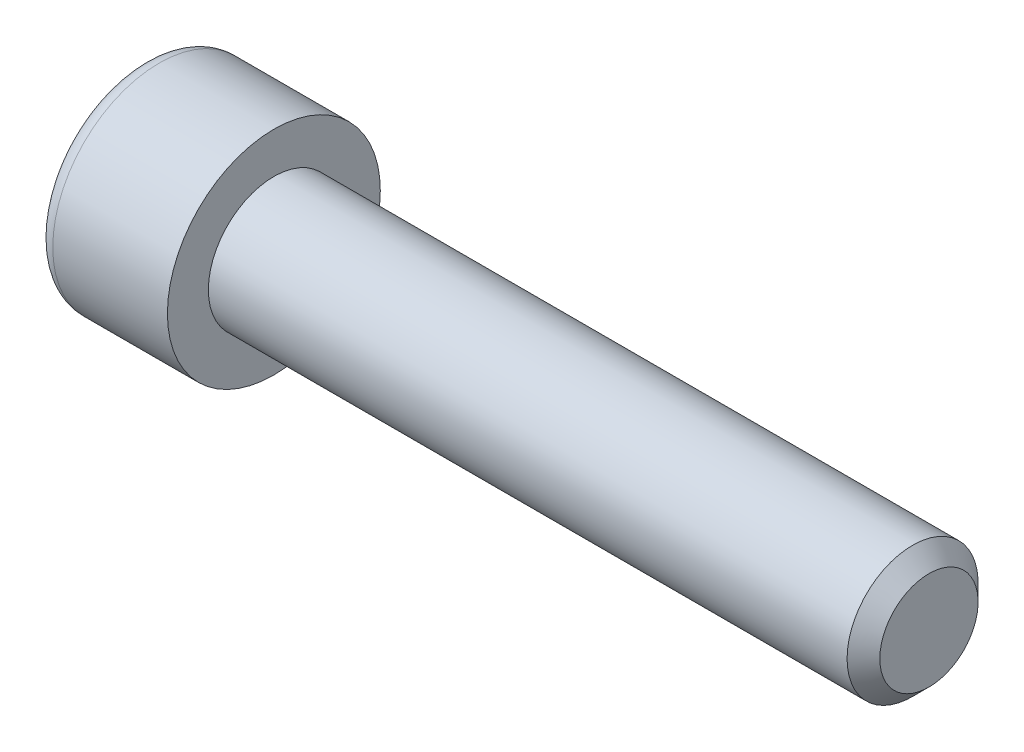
ISO-10303-21;
HEADER;
FILE_DESCRIPTION(('STEP AP214'),'2;1');
FILE_NAME('part.step','',(''),(''),'','','');
FILE_SCHEMA(('AUTOMOTIVE_DESIGN { 1 0 10303 214 1 1 1 1 }'));
ENDSEC;
DATA;
#1=APPLICATION_CONTEXT('core data for automotive mechanical design processes');
#2=APPLICATION_PROTOCOL_DEFINITION('international standard','automotive_design',2000,#1);
#3=PRODUCT_CONTEXT('',#1,'mechanical');
#4=PRODUCT('Part','Part','',(#3));
#5=PRODUCT_RELATED_PRODUCT_CATEGORY('part','',(#4));
#6=PRODUCT_DEFINITION_FORMATION('','',#4);
#7=PRODUCT_DEFINITION_CONTEXT('part definition',#1,'design');
#8=PRODUCT_DEFINITION('design','',#6,#7);
#9=PRODUCT_DEFINITION_SHAPE('','',#8);
#10=(LENGTH_UNIT() NAMED_UNIT(*) SI_UNIT(.MILLI.,.METRE.));
#11=(NAMED_UNIT(*) PLANE_ANGLE_UNIT() SI_UNIT($,.RADIAN.));
#12=(NAMED_UNIT(*) SI_UNIT($,.STERADIAN.) SOLID_ANGLE_UNIT());
#13=UNCERTAINTY_MEASURE_WITH_UNIT(LENGTH_MEASURE(1.E-05),#10,'distance_accuracy_value','');
#14=(GEOMETRIC_REPRESENTATION_CONTEXT(3) GLOBAL_UNCERTAINTY_ASSIGNED_CONTEXT((#13)) GLOBAL_UNIT_ASSIGNED_CONTEXT((#10,
#11,#12)) REPRESENTATION_CONTEXT('',''));
#15=CARTESIAN_POINT('',(0.,0.,0.));
#16=DIRECTION('',(0.,0.,1.));
#17=DIRECTION('',(1.,0.,0.));
#18=AXIS2_PLACEMENT_3D('',#15,#16,#17);
#19=CARTESIAN_POINT('',(-8.,0.,0.));
#20=DIRECTION('',(-1.,0.,0.));
#21=DIRECTION('',(0.,0.,1.));
#22=AXIS2_PLACEMENT_3D('',#19,#20,#21);
#23=PLANE('',#22);
#24=CARTESIAN_POINT('',(-8.,0.,0.));
#25=DIRECTION('',(-1.,0.,0.));
#26=DIRECTION('',(0.,0.,1.));
#27=AXIS2_PLACEMENT_3D('',#24,#25,#26);
#28=CIRCLE('',#27,5.49999999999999);
#29=CARTESIAN_POINT('',(-8.,0.,5.49999999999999));
#30=VERTEX_POINT('',#29);
#31=EDGE_CURVE('E101',#30,#30,#28,.T.);
#32=ORIENTED_EDGE('',*,*,#31,.T.);
#33=EDGE_LOOP('',(#32));
#34=FACE_BOUND('',#33,.T.);
#35=DIRECTION('',(0.,0.866025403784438,-0.5));
#36=VECTOR('',#35,1.);
#37=CARTESIAN_POINT('',(-8.,-3.08460754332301,-1.73205080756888));
#38=LINE('',#37,#36);
#39=CARTESIAN_POINT('',(-8.,-3.08460754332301,-1.73205080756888));
#40=VERTEX_POINT('',#39);
#41=CARTESIAN_POINT('',(-8.,-0.0846075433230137,-3.46410161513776));
#42=VERTEX_POINT('',#41);
#43=EDGE_CURVE('E106',#40,#42,#38,.T.);
#44=ORIENTED_EDGE('',*,*,#43,.T.);
#45=DIRECTION('',(0.,0.866025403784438,0.5));
#46=VECTOR('',#45,1.);
#47=CARTESIAN_POINT('',(-8.,-0.0846075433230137,-3.46410161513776));
#48=LINE('',#47,#46);
#49=CARTESIAN_POINT('',(-8.,2.91539245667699,-1.73205080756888));
#50=VERTEX_POINT('',#49);
#51=EDGE_CURVE('E47',#42,#50,#48,.T.);
#52=ORIENTED_EDGE('',*,*,#51,.T.);
#53=DIRECTION('',(0.,0.,1.));
#54=VECTOR('',#53,1.);
#55=CARTESIAN_POINT('',(-8.,2.91539245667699,-1.73205080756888));
#56=LINE('',#55,#54);
#57=CARTESIAN_POINT('',(-8.,2.91539245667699,1.73205080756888));
#58=VERTEX_POINT('',#57);
#59=EDGE_CURVE('E87',#50,#58,#56,.T.);
#60=ORIENTED_EDGE('',*,*,#59,.T.);
#61=DIRECTION('',(0.,-0.866025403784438,0.500000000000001));
#62=VECTOR('',#61,1.);
#63=CARTESIAN_POINT('',(-8.,2.91539245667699,1.73205080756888));
#64=LINE('',#63,#62);
#65=CARTESIAN_POINT('',(-8.,-0.0846075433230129,3.46410161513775));
#66=VERTEX_POINT('',#65);
#67=EDGE_CURVE('E95',#58,#66,#64,.T.);
#68=ORIENTED_EDGE('',*,*,#67,.T.);
#69=DIRECTION('',(0.,-0.866025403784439,-0.5));
#70=VECTOR('',#69,1.);
#71=CARTESIAN_POINT('',(-8.,-0.0846075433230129,3.46410161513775));
#72=LINE('',#71,#70);
#73=CARTESIAN_POINT('',(-8.,-3.08460754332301,1.73205080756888));
#74=VERTEX_POINT('',#73);
#75=EDGE_CURVE('E110',#66,#74,#72,.T.);
#76=ORIENTED_EDGE('',*,*,#75,.T.);
#77=DIRECTION('',(0.,0.,-1.));
#78=VECTOR('',#77,1.);
#79=CARTESIAN_POINT('',(-8.,-3.08460754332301,1.73205080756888));
#80=LINE('',#79,#78);
#81=EDGE_CURVE('E113',#74,#40,#80,.T.);
#82=ORIENTED_EDGE('',*,*,#81,.T.);
#83=EDGE_LOOP('',(#44,#52,#60,#68,#76,#82));
#84=FACE_BOUND('',#83,.T.);
#85=ADVANCED_FACE('F32',(#34,#84),#23,.T.);
#86=CARTESIAN_POINT('',(40.,3.,0.));
#87=DIRECTION('',(1.,0.,0.));
#88=DIRECTION('',(0.,0.,-1.));
#89=AXIS2_PLACEMENT_3D('',#86,#87,#88);
#90=PLANE('',#89);
#91=CARTESIAN_POINT('',(40.,0.,0.));
#92=DIRECTION('',(-1.,0.,0.));
#93=DIRECTION('',(0.,0.,1.));
#94=AXIS2_PLACEMENT_3D('',#91,#92,#93);
#95=CIRCLE('',#94,3.);
#96=CARTESIAN_POINT('',(40.,0.,3.));
#97=VERTEX_POINT('',#96);
#98=EDGE_CURVE('E11',#97,#97,#95,.T.);
#99=ORIENTED_EDGE('',*,*,#98,.F.);
#100=EDGE_LOOP('',(#99));
#101=FACE_BOUND('',#100,.T.);
#102=ADVANCED_FACE('F34',(#101),#90,.T.);
#103=CARTESIAN_POINT('',(39.,0.,0.));
#104=DIRECTION('',(-1.,0.,0.));
#105=DIRECTION('',(0.,0.,1.));
#106=AXIS2_PLACEMENT_3D('',#103,#104,#105);
#107=CONICAL_SURFACE('',#106,3.99999999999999,0.785398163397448);
#108=ORIENTED_EDGE('',*,*,#98,.T.);
#109=EDGE_LOOP('',(#108));
#110=FACE_BOUND('',#109,.T.);
#111=CARTESIAN_POINT('',(39.,0.,0.));
#112=DIRECTION('',(-1.,0.,0.));
#113=DIRECTION('',(0.,0.,1.));
#114=AXIS2_PLACEMENT_3D('',#111,#112,#113);
#115=CIRCLE('',#114,3.99999999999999);
#116=CARTESIAN_POINT('',(39.,0.,3.99999999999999));
#117=VERTEX_POINT('',#116);
#118=EDGE_CURVE('E40',#117,#117,#115,.T.);
#119=ORIENTED_EDGE('',*,*,#118,.F.);
#120=EDGE_LOOP('',(#119));
#121=FACE_BOUND('',#120,.T.);
#122=ADVANCED_FACE('F151',(#110,#121),#107,.T.);
#123=CARTESIAN_POINT('',(-28.5761966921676,0.,0.));
#124=DIRECTION('',(-1.,0.,0.));
#125=DIRECTION('',(0.,0.,1.));
#126=AXIS2_PLACEMENT_3D('',#123,#124,#125);
#127=CYLINDRICAL_SURFACE('',#126,3.99999999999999);
#128=ORIENTED_EDGE('',*,*,#118,.T.);
#129=EDGE_LOOP('',(#128));
#130=FACE_BOUND('',#129,.T.);
#131=CARTESIAN_POINT('',(0.,0.,0.));
#132=DIRECTION('',(-1.,0.,0.));
#133=DIRECTION('',(0.,0.,1.));
#134=AXIS2_PLACEMENT_3D('',#131,#132,#133);
#135=CIRCLE('',#134,3.99999999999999);
#136=CARTESIAN_POINT('',(0.,0.,3.99999999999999));
#137=VERTEX_POINT('',#136);
#138=EDGE_CURVE('E143',#137,#137,#135,.T.);
#139=ORIENTED_EDGE('',*,*,#138,.F.);
#140=EDGE_LOOP('',(#139));
#141=FACE_BOUND('',#140,.T.);
#142=ADVANCED_FACE('F148',(#130,#141),#127,.T.);
#143=CARTESIAN_POINT('',(0.,6.49999999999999,0.));
#144=DIRECTION('',(1.,0.,0.));
#145=DIRECTION('',(0.,0.,-1.));
#146=AXIS2_PLACEMENT_3D('',#143,#144,#145);
#147=PLANE('',#146);
#148=ORIENTED_EDGE('',*,*,#138,.T.);
#149=EDGE_LOOP('',(#148));
#150=FACE_BOUND('',#149,.T.);
#151=CARTESIAN_POINT('',(0.,0.,0.));
#152=DIRECTION('',(-1.,0.,0.));
#153=DIRECTION('',(0.,0.,1.));
#154=AXIS2_PLACEMENT_3D('',#151,#152,#153);
#155=CIRCLE('',#154,6.49999999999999);
#156=CARTESIAN_POINT('',(0.,0.,6.49999999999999));
#157=VERTEX_POINT('',#156);
#158=EDGE_CURVE('E140',#157,#157,#155,.T.);
#159=ORIENTED_EDGE('',*,*,#158,.F.);
#160=EDGE_LOOP('',(#159));
#161=FACE_BOUND('',#160,.T.);
#162=ADVANCED_FACE('F158',(#150,#161),#147,.T.);
#163=CARTESIAN_POINT('',(-28.5761966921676,0.,0.));
#164=DIRECTION('',(-1.,0.,0.));
#165=DIRECTION('',(0.,0.,1.));
#166=AXIS2_PLACEMENT_3D('',#163,#164,#165);
#167=CYLINDRICAL_SURFACE('',#166,6.49999999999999);
#168=ORIENTED_EDGE('',*,*,#158,.T.);
#169=EDGE_LOOP('',(#168));
#170=FACE_BOUND('',#169,.T.);
#171=CARTESIAN_POINT('',(-7.,0.,0.));
#172=DIRECTION('',(-1.,0.,0.));
#173=DIRECTION('',(0.,0.,1.));
#174=AXIS2_PLACEMENT_3D('',#171,#172,#173);
#175=CIRCLE('',#174,6.49999999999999);
#176=CARTESIAN_POINT('',(-7.,0.,6.49999999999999));
#177=VERTEX_POINT('',#176);
#178=EDGE_CURVE('E137',#177,#177,#175,.T.);
#179=ORIENTED_EDGE('',*,*,#178,.F.);
#180=EDGE_LOOP('',(#179));
#181=FACE_BOUND('',#180,.T.);
#182=ADVANCED_FACE('F172',(#170,#181),#167,.T.);
#183=CARTESIAN_POINT('',(-7.,0.,0.));
#184=DIRECTION('',(-1.,0.,0.));
#185=DIRECTION('',(0.,0.,1.));
#186=AXIS2_PLACEMENT_3D('',#183,#184,#185);
#187=TOROIDAL_SURFACE('',#186,5.49999999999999,1.);
#188=ORIENTED_EDGE('',*,*,#31,.F.);
#189=EDGE_LOOP('',(#188));
#190=FACE_BOUND('',#189,.T.);
#191=ORIENTED_EDGE('',*,*,#178,.T.);
#192=EDGE_LOOP('',(#191));
#193=FACE_BOUND('',#192,.T.);
#194=ADVANCED_FACE('F169',(#190,#193),#187,.T.);
#195=CARTESIAN_POINT('',(-4.,-0.0846075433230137,-3.46410161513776));
#196=DIRECTION('',(0.,-0.5,0.866025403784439));
#197=DIRECTION('',(0.,-0.866025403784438,-0.5));
#198=AXIS2_PLACEMENT_3D('',#195,#196,#197);
#199=PLANE('',#198);
#200=ORIENTED_EDGE('',*,*,#51,.F.);
#201=DIRECTION('',(-1.,0.,0.));
#202=VECTOR('',#201,1.);
#203=CARTESIAN_POINT('',(-4.,-0.0846075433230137,-3.46410161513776));
#204=LINE('',#203,#202);
#205=CARTESIAN_POINT('',(-4.,-0.0846075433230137,-3.46410161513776));
#206=VERTEX_POINT('',#205);
#207=EDGE_CURVE('E126',#206,#42,#204,.T.);
#208=ORIENTED_EDGE('',*,*,#207,.F.);
#209=DIRECTION('',(0.,0.866025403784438,0.5));
#210=VECTOR('',#209,1.);
#211=CARTESIAN_POINT('',(-4.,-0.0846075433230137,-3.46410161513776));
#212=LINE('',#211,#210);
#213=CARTESIAN_POINT('',(-4.,2.91539245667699,-1.73205080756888));
#214=VERTEX_POINT('',#213);
#215=EDGE_CURVE('E100',#206,#214,#212,.T.);
#216=ORIENTED_EDGE('',*,*,#215,.T.);
#217=DIRECTION('',(-1.,0.,0.));
#218=VECTOR('',#217,1.);
#219=CARTESIAN_POINT('',(-4.,2.91539245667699,-1.73205080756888));
#220=LINE('',#219,#218);
#221=EDGE_CURVE('E89',#214,#50,#220,.T.);
#222=ORIENTED_EDGE('',*,*,#221,.T.);
#223=EDGE_LOOP('',(#200,#208,#216,#222));
#224=FACE_BOUND('',#223,.T.);
#225=ADVANCED_FACE('F98',(#224),#199,.T.);
#226=CARTESIAN_POINT('',(-4.,2.91539245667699,-1.73205080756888));
#227=DIRECTION('',(0.,-1.,0.));
#228=DIRECTION('',(0.,0.,-1.));
#229=AXIS2_PLACEMENT_3D('',#226,#227,#228);
#230=PLANE('',#229);
#231=ORIENTED_EDGE('',*,*,#59,.F.);
#232=ORIENTED_EDGE('',*,*,#221,.F.);
#233=DIRECTION('',(0.,0.,1.));
#234=VECTOR('',#233,1.);
#235=CARTESIAN_POINT('',(-4.,2.91539245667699,-1.73205080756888));
#236=LINE('',#235,#234);
#237=CARTESIAN_POINT('',(-4.,2.91539245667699,1.73205080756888));
#238=VERTEX_POINT('',#237);
#239=EDGE_CURVE('E117',#214,#238,#236,.T.);
#240=ORIENTED_EDGE('',*,*,#239,.T.);
#241=DIRECTION('',(-1.,0.,0.));
#242=VECTOR('',#241,1.);
#243=CARTESIAN_POINT('',(-4.,2.91539245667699,1.73205080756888));
#244=LINE('',#243,#242);
#245=EDGE_CURVE('E91',#238,#58,#244,.T.);
#246=ORIENTED_EDGE('',*,*,#245,.T.);
#247=EDGE_LOOP('',(#231,#232,#240,#246));
#248=FACE_BOUND('',#247,.T.);
#249=ADVANCED_FACE('F88',(#248),#230,.T.);
#250=CARTESIAN_POINT('',(-4.,2.91539245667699,1.73205080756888));
#251=DIRECTION('',(0.,-0.500000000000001,-0.866025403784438));
#252=DIRECTION('',(0.,0.866025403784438,-0.500000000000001));
#253=AXIS2_PLACEMENT_3D('',#250,#251,#252);
#254=PLANE('',#253);
#255=ORIENTED_EDGE('',*,*,#67,.F.);
#256=ORIENTED_EDGE('',*,*,#245,.F.);
#257=DIRECTION('',(0.,-0.866025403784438,0.500000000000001));
#258=VECTOR('',#257,1.);
#259=CARTESIAN_POINT('',(-4.,2.91539245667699,1.73205080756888));
#260=LINE('',#259,#258);
#261=CARTESIAN_POINT('',(-4.,-0.0846075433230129,3.46410161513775));
#262=VERTEX_POINT('',#261);
#263=EDGE_CURVE('E119',#238,#262,#260,.T.);
#264=ORIENTED_EDGE('',*,*,#263,.T.);
#265=DIRECTION('',(-1.,0.,0.));
#266=VECTOR('',#265,1.);
#267=CARTESIAN_POINT('',(-4.,-0.0846075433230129,3.46410161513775));
#268=LINE('',#267,#266);
#269=EDGE_CURVE('E132',#262,#66,#268,.T.);
#270=ORIENTED_EDGE('',*,*,#269,.T.);
#271=EDGE_LOOP('',(#255,#256,#264,#270));
#272=FACE_BOUND('',#271,.T.);
#273=ADVANCED_FACE('F209',(#272),#254,.T.);
#274=CARTESIAN_POINT('',(-4.,-0.0846075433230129,3.46410161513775));
#275=DIRECTION('',(0.,0.5,-0.866025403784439));
#276=DIRECTION('',(0.,0.866025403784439,0.5));
#277=AXIS2_PLACEMENT_3D('',#274,#275,#276);
#278=PLANE('',#277);
#279=ORIENTED_EDGE('',*,*,#75,.F.);
#280=ORIENTED_EDGE('',*,*,#269,.F.);
#281=DIRECTION('',(0.,-0.866025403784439,-0.5));
#282=VECTOR('',#281,1.);
#283=CARTESIAN_POINT('',(-4.,-0.0846075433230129,3.46410161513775));
#284=LINE('',#283,#282);
#285=CARTESIAN_POINT('',(-4.,-3.08460754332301,1.73205080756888));
#286=VERTEX_POINT('',#285);
#287=EDGE_CURVE('E121',#262,#286,#284,.T.);
#288=ORIENTED_EDGE('',*,*,#287,.T.);
#289=DIRECTION('',(-1.,0.,0.));
#290=VECTOR('',#289,1.);
#291=CARTESIAN_POINT('',(-4.,-3.08460754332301,1.73205080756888));
#292=LINE('',#291,#290);
#293=EDGE_CURVE('E130',#286,#74,#292,.T.);
#294=ORIENTED_EDGE('',*,*,#293,.T.);
#295=EDGE_LOOP('',(#279,#280,#288,#294));
#296=FACE_BOUND('',#295,.T.);
#297=ADVANCED_FACE('F215',(#296),#278,.T.);
#298=CARTESIAN_POINT('',(-4.,-3.08460754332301,1.73205080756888));
#299=DIRECTION('',(0.,1.,0.));
#300=DIRECTION('',(0.,0.,1.));
#301=AXIS2_PLACEMENT_3D('',#298,#299,#300);
#302=PLANE('',#301);
#303=ORIENTED_EDGE('',*,*,#81,.F.);
#304=ORIENTED_EDGE('',*,*,#293,.F.);
#305=DIRECTION('',(0.,0.,-1.));
#306=VECTOR('',#305,1.);
#307=CARTESIAN_POINT('',(-4.,-3.08460754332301,1.73205080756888));
#308=LINE('',#307,#306);
#309=CARTESIAN_POINT('',(-4.,-3.08460754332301,-1.73205080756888));
#310=VERTEX_POINT('',#309);
#311=EDGE_CURVE('E123',#286,#310,#308,.T.);
#312=ORIENTED_EDGE('',*,*,#311,.T.);
#313=DIRECTION('',(-1.,0.,0.));
#314=VECTOR('',#313,1.);
#315=CARTESIAN_POINT('',(-4.,-3.08460754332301,-1.73205080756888));
#316=LINE('',#315,#314);
#317=EDGE_CURVE('E128',#310,#40,#316,.T.);
#318=ORIENTED_EDGE('',*,*,#317,.T.);
#319=EDGE_LOOP('',(#303,#304,#312,#318));
#320=FACE_BOUND('',#319,.T.);
#321=ADVANCED_FACE('F223',(#320),#302,.T.);
#322=CARTESIAN_POINT('',(-4.,-3.08460754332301,-1.73205080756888));
#323=DIRECTION('',(0.,0.5,0.866025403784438));
#324=DIRECTION('',(0.,-0.866025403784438,0.5));
#325=AXIS2_PLACEMENT_3D('',#322,#323,#324);
#326=PLANE('',#325);
#327=ORIENTED_EDGE('',*,*,#43,.F.);
#328=ORIENTED_EDGE('',*,*,#317,.F.);
#329=DIRECTION('',(0.,0.866025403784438,-0.5));
#330=VECTOR('',#329,1.);
#331=CARTESIAN_POINT('',(-4.,-3.08460754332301,-1.73205080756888));
#332=LINE('',#331,#330);
#333=EDGE_CURVE('E54',#310,#206,#332,.T.);
#334=ORIENTED_EDGE('',*,*,#333,.T.);
#335=ORIENTED_EDGE('',*,*,#207,.T.);
#336=EDGE_LOOP('',(#327,#328,#334,#335));
#337=FACE_BOUND('',#336,.T.);
#338=ADVANCED_FACE('F231',(#337),#326,.T.);
#339=CARTESIAN_POINT('',(-4.,5.91539245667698,0.));
#340=DIRECTION('',(1.,0.,0.));
#341=DIRECTION('',(0.,0.,-1.));
#342=AXIS2_PLACEMENT_3D('',#339,#340,#341);
#343=PLANE('',#342);
#344=ORIENTED_EDGE('',*,*,#215,.F.);
#345=ORIENTED_EDGE('',*,*,#333,.F.);
#346=ORIENTED_EDGE('',*,*,#311,.F.);
#347=ORIENTED_EDGE('',*,*,#287,.F.);
#348=ORIENTED_EDGE('',*,*,#263,.F.);
#349=ORIENTED_EDGE('',*,*,#239,.F.);
#350=EDGE_LOOP('',(#344,#345,#346,#347,#348,#349));
#351=FACE_BOUND('',#350,.T.);
#352=ADVANCED_FACE('F239',(#351),#343,.F.);
#353=CLOSED_SHELL('',(#85,#102,#122,#142,#162,#182,#194,#225,#249,#273,#297,#321,#338,#352));
#354=MANIFOLD_SOLID_BREP('B2',#353);
#355=ADVANCED_BREP_SHAPE_REPRESENTATION('',(#18,#354),#14);
#356=SHAPE_DEFINITION_REPRESENTATION(#9,#355);
ENDSEC;
END-ISO-10303-21;
